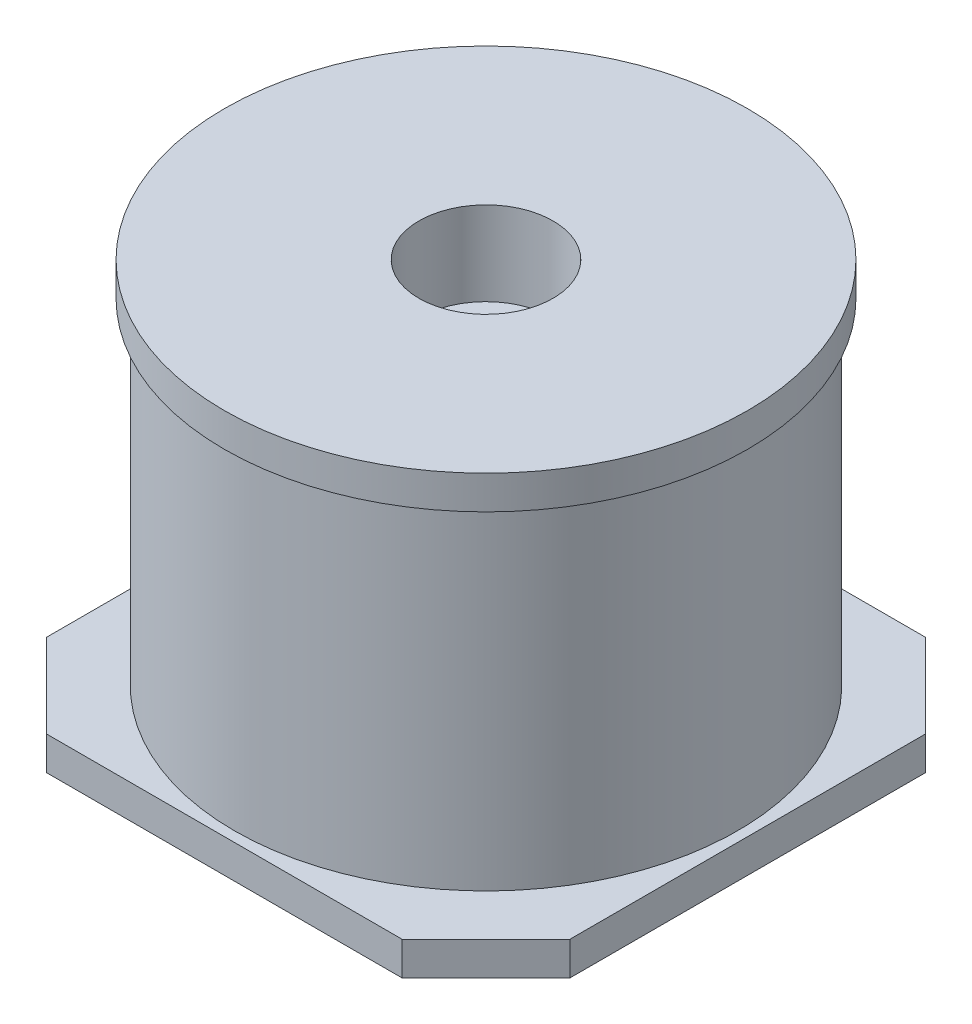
ISO-10303-21;
HEADER;
FILE_DESCRIPTION(('STEP AP214'),'2;1');
FILE_NAME('part.step','',(''),(''),'','','');
FILE_SCHEMA(('AUTOMOTIVE_DESIGN { 1 0 10303 214 1 1 1 1 }'));
ENDSEC;
DATA;
#1=APPLICATION_CONTEXT('core data for automotive mechanical design processes');
#2=APPLICATION_PROTOCOL_DEFINITION('international standard','automotive_design',2000,#1);
#3=PRODUCT_CONTEXT('',#1,'mechanical');
#4=PRODUCT('Part','Part','',(#3));
#5=PRODUCT_RELATED_PRODUCT_CATEGORY('part','',(#4));
#6=PRODUCT_DEFINITION_FORMATION('','',#4);
#7=PRODUCT_DEFINITION_CONTEXT('part definition',#1,'design');
#8=PRODUCT_DEFINITION('design','',#6,#7);
#9=PRODUCT_DEFINITION_SHAPE('','',#8);
#10=(LENGTH_UNIT() NAMED_UNIT(*) SI_UNIT(.MILLI.,.METRE.));
#11=(NAMED_UNIT(*) PLANE_ANGLE_UNIT() SI_UNIT($,.RADIAN.));
#12=(NAMED_UNIT(*) SI_UNIT($,.STERADIAN.) SOLID_ANGLE_UNIT());
#13=UNCERTAINTY_MEASURE_WITH_UNIT(LENGTH_MEASURE(1.E-05),#10,'distance_accuracy_value','');
#14=(GEOMETRIC_REPRESENTATION_CONTEXT(3) GLOBAL_UNCERTAINTY_ASSIGNED_CONTEXT((#13)) GLOBAL_UNIT_ASSIGNED_CONTEXT((#10,
#11,#12)) REPRESENTATION_CONTEXT('',''));
#15=CARTESIAN_POINT('',(0.,0.,0.));
#16=DIRECTION('',(0.,0.,1.));
#17=DIRECTION('',(1.,0.,0.));
#18=AXIS2_PLACEMENT_3D('',#15,#16,#17);
#19=CARTESIAN_POINT('',(0.,5.08,0.));
#20=DIRECTION('',(0.,-1.,0.));
#21=DIRECTION('',(0.,0.,-1.));
#22=AXIS2_PLACEMENT_3D('',#19,#20,#21);
#23=CYLINDRICAL_SURFACE('',#22,3.81);
#24=CARTESIAN_POINT('',(0.,5.08,0.));
#25=DIRECTION('',(0.,1.,0.));
#26=DIRECTION('',(0.,0.,1.));
#27=AXIS2_PLACEMENT_3D('',#24,#25,#26);
#28=CIRCLE('',#27,3.81);
#29=CARTESIAN_POINT('',(0.,5.08,3.81));
#30=VERTEX_POINT('',#29);
#31=EDGE_CURVE('E11',#30,#30,#28,.T.);
#32=ORIENTED_EDGE('',*,*,#31,.F.);
#33=EDGE_LOOP('',(#32));
#34=FACE_BOUND('',#33,.T.);
#35=CARTESIAN_POINT('',(0.,0.,0.));
#36=DIRECTION('',(0.,-1.,0.));
#37=DIRECTION('',(0.,0.,-1.));
#38=AXIS2_PLACEMENT_3D('',#35,#36,#37);
#39=CIRCLE('',#38,3.81);
#40=CARTESIAN_POINT('',(0.,0.,-3.81));
#41=VERTEX_POINT('',#40);
#42=EDGE_CURVE('E161',#41,#41,#39,.T.);
#43=ORIENTED_EDGE('',*,*,#42,.F.);
#44=EDGE_LOOP('',(#43));
#45=FACE_BOUND('',#44,.T.);
#46=ADVANCED_FACE('F34',(#34,#45),#23,.T.);
#47=CARTESIAN_POINT('',(0.,5.588,0.));
#48=DIRECTION('',(0.,-1.,0.));
#49=DIRECTION('',(0.,0.,-1.));
#50=AXIS2_PLACEMENT_3D('',#47,#48,#49);
#51=CYLINDRICAL_SURFACE('',#50,3.9624);
#52=CARTESIAN_POINT('',(0.,5.588,0.));
#53=DIRECTION('',(0.,1.,0.));
#54=DIRECTION('',(0.,0.,1.));
#55=AXIS2_PLACEMENT_3D('',#52,#53,#54);
#56=CIRCLE('',#55,3.9624);
#57=CARTESIAN_POINT('',(0.,5.588,3.9624));
#58=VERTEX_POINT('',#57);
#59=EDGE_CURVE('E42',#58,#58,#56,.T.);
#60=ORIENTED_EDGE('',*,*,#59,.F.);
#61=EDGE_LOOP('',(#60));
#62=FACE_BOUND('',#61,.T.);
#63=CARTESIAN_POINT('',(0.,5.08,0.));
#64=DIRECTION('',(0.,1.,0.));
#65=DIRECTION('',(0.,0.,1.));
#66=AXIS2_PLACEMENT_3D('',#63,#64,#65);
#67=CIRCLE('',#66,3.9624);
#68=CARTESIAN_POINT('',(0.,5.08,3.9624));
#69=VERTEX_POINT('',#68);
#70=EDGE_CURVE('E168',#69,#69,#67,.T.);
#71=ORIENTED_EDGE('',*,*,#70,.T.);
#72=EDGE_LOOP('',(#71));
#73=FACE_BOUND('',#72,.T.);
#74=ADVANCED_FACE('F175',(#62,#73),#51,.T.);
#75=CARTESIAN_POINT('',(0.,5.588,0.));
#76=DIRECTION('',(0.,1.,0.));
#77=DIRECTION('',(0.,0.,1.));
#78=AXIS2_PLACEMENT_3D('',#75,#76,#77);
#79=PLANE('',#78);
#80=CARTESIAN_POINT('',(0.,5.588,0.));
#81=DIRECTION('',(0.,1.,0.));
#82=DIRECTION('',(0.,0.,1.));
#83=AXIS2_PLACEMENT_3D('',#80,#81,#82);
#84=CIRCLE('',#83,1.016);
#85=CARTESIAN_POINT('',(0.,5.588,1.016));
#86=VERTEX_POINT('',#85);
#87=EDGE_CURVE('E164',#86,#86,#84,.T.);
#88=ORIENTED_EDGE('',*,*,#87,.F.);
#89=EDGE_LOOP('',(#88));
#90=FACE_BOUND('',#89,.T.);
#91=ORIENTED_EDGE('',*,*,#59,.T.);
#92=EDGE_LOOP('',(#91));
#93=FACE_BOUND('',#92,.T.);
#94=ADVANCED_FACE('F180',(#90,#93),#79,.T.);
#95=CARTESIAN_POINT('',(0.,5.08,0.));
#96=DIRECTION('',(0.,1.,0.));
#97=DIRECTION('',(0.,0.,1.));
#98=AXIS2_PLACEMENT_3D('',#95,#96,#97);
#99=PLANE('',#98);
#100=ORIENTED_EDGE('',*,*,#31,.T.);
#101=EDGE_LOOP('',(#100));
#102=FACE_BOUND('',#101,.T.);
#103=ORIENTED_EDGE('',*,*,#70,.F.);
#104=EDGE_LOOP('',(#103));
#105=FACE_BOUND('',#104,.T.);
#106=ADVANCED_FACE('F177',(#102,#105),#99,.F.);
#107=CARTESIAN_POINT('',(0.,4.318,0.));
#108=DIRECTION('',(0.,1.,0.));
#109=DIRECTION('',(0.,0.,1.));
#110=AXIS2_PLACEMENT_3D('',#107,#108,#109);
#111=CYLINDRICAL_SURFACE('',#110,1.016);
#112=CARTESIAN_POINT('',(0.,4.318,0.));
#113=DIRECTION('',(0.,1.,0.));
#114=DIRECTION('',(0.,0.,1.));
#115=AXIS2_PLACEMENT_3D('',#112,#113,#114);
#116=CIRCLE('',#115,1.016);
#117=CARTESIAN_POINT('',(0.,4.318,1.016));
#118=VERTEX_POINT('',#117);
#119=EDGE_CURVE('E165',#118,#118,#116,.T.);
#120=ORIENTED_EDGE('',*,*,#119,.F.);
#121=EDGE_LOOP('',(#120));
#122=FACE_BOUND('',#121,.T.);
#123=ORIENTED_EDGE('',*,*,#87,.T.);
#124=EDGE_LOOP('',(#123));
#125=FACE_BOUND('',#124,.T.);
#126=ADVANCED_FACE('F179',(#122,#125),#111,.F.);
#127=CARTESIAN_POINT('',(0.,4.318,0.));
#128=DIRECTION('',(0.,1.,0.));
#129=DIRECTION('',(0.,0.,1.));
#130=AXIS2_PLACEMENT_3D('',#127,#128,#129);
#131=PLANE('',#130);
#132=ORIENTED_EDGE('',*,*,#119,.T.);
#133=EDGE_LOOP('',(#132));
#134=FACE_BOUND('',#133,.T.);
#135=ADVANCED_FACE('F187',(#134),#131,.T.);
#136=CARTESIAN_POINT('',(-2.6924,-0.508,3.9624));
#137=DIRECTION('',(0.,0.,-1.));
#138=DIRECTION('',(-1.,0.,0.));
#139=AXIS2_PLACEMENT_3D('',#136,#137,#138);
#140=PLANE('',#139);
#141=DIRECTION('',(-1.,0.,0.));
#142=VECTOR('',#141,1.);
#143=CARTESIAN_POINT('',(-2.6924,0.,3.9624));
#144=LINE('',#143,#142);
#145=CARTESIAN_POINT('',(2.6924,0.,3.9624));
#146=VERTEX_POINT('',#145);
#147=CARTESIAN_POINT('',(-2.6924,0.,3.9624));
#148=VERTEX_POINT('',#147);
#149=EDGE_CURVE('E131',#146,#148,#144,.T.);
#150=ORIENTED_EDGE('',*,*,#149,.T.);
#151=DIRECTION('',(0.,1.,0.));
#152=VECTOR('',#151,1.);
#153=CARTESIAN_POINT('',(-2.6924,-0.508,3.9624));
#154=LINE('',#153,#152);
#155=CARTESIAN_POINT('',(-2.6924,-0.508,3.9624));
#156=VERTEX_POINT('',#155);
#157=EDGE_CURVE('E159',#156,#148,#154,.T.);
#158=ORIENTED_EDGE('',*,*,#157,.F.);
#159=DIRECTION('',(-1.,0.,0.));
#160=VECTOR('',#159,1.);
#161=CARTESIAN_POINT('',(-2.6924,-0.508,3.9624));
#162=LINE('',#161,#160);
#163=CARTESIAN_POINT('',(2.6924,-0.508,3.9624));
#164=VERTEX_POINT('',#163);
#165=EDGE_CURVE('E146',#164,#156,#162,.T.);
#166=ORIENTED_EDGE('',*,*,#165,.F.);
#167=DIRECTION('',(0.,1.,0.));
#168=VECTOR('',#167,1.);
#169=CARTESIAN_POINT('',(2.6924,-0.508,3.9624));
#170=LINE('',#169,#168);
#171=EDGE_CURVE('E127',#164,#146,#170,.T.);
#172=ORIENTED_EDGE('',*,*,#171,.T.);
#173=EDGE_LOOP('',(#150,#158,#166,#172));
#174=FACE_BOUND('',#173,.T.);
#175=ADVANCED_FACE('F211',(#174),#140,.F.);
#176=CARTESIAN_POINT('',(-3.9624,-0.508,2.6924));
#177=DIRECTION('',(0.707106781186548,0.,-0.707106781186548));
#178=DIRECTION('',(-0.707106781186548,0.,-0.707106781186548));
#179=AXIS2_PLACEMENT_3D('',#176,#177,#178);
#180=PLANE('',#179);
#181=DIRECTION('',(-0.707106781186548,0.,-0.707106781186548));
#182=VECTOR('',#181,1.);
#183=CARTESIAN_POINT('',(-3.9624,0.,2.6924));
#184=LINE('',#183,#182);
#185=CARTESIAN_POINT('',(-3.9624,0.,2.6924));
#186=VERTEX_POINT('',#185);
#187=EDGE_CURVE('E134',#148,#186,#184,.T.);
#188=ORIENTED_EDGE('',*,*,#187,.T.);
#189=DIRECTION('',(0.,1.,0.));
#190=VECTOR('',#189,1.);
#191=CARTESIAN_POINT('',(-3.9624,-0.508,2.6924));
#192=LINE('',#191,#190);
#193=CARTESIAN_POINT('',(-3.9624,-0.508,2.6924));
#194=VERTEX_POINT('',#193);
#195=EDGE_CURVE('E156',#194,#186,#192,.T.);
#196=ORIENTED_EDGE('',*,*,#195,.F.);
#197=DIRECTION('',(-0.707106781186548,0.,-0.707106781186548));
#198=VECTOR('',#197,1.);
#199=CARTESIAN_POINT('',(-3.9624,-0.508,2.6924));
#200=LINE('',#199,#198);
#201=EDGE_CURVE('E94',#156,#194,#200,.T.);
#202=ORIENTED_EDGE('',*,*,#201,.F.);
#203=ORIENTED_EDGE('',*,*,#157,.T.);
#204=EDGE_LOOP('',(#188,#196,#202,#203));
#205=FACE_BOUND('',#204,.T.);
#206=ADVANCED_FACE('F237',(#205),#180,.F.);
#207=CARTESIAN_POINT('',(-3.9624,-0.508,-2.6924));
#208=DIRECTION('',(1.,0.,0.));
#209=DIRECTION('',(0.,0.,-1.));
#210=AXIS2_PLACEMENT_3D('',#207,#208,#209);
#211=PLANE('',#210);
#212=DIRECTION('',(0.,0.,-1.));
#213=VECTOR('',#212,1.);
#214=CARTESIAN_POINT('',(-3.9624,0.,-2.6924));
#215=LINE('',#214,#213);
#216=CARTESIAN_POINT('',(-3.9624,0.,-2.6924));
#217=VERTEX_POINT('',#216);
#218=EDGE_CURVE('E137',#186,#217,#215,.T.);
#219=ORIENTED_EDGE('',*,*,#218,.T.);
#220=DIRECTION('',(0.,1.,0.));
#221=VECTOR('',#220,1.);
#222=CARTESIAN_POINT('',(-3.9624,-0.508,-2.6924));
#223=LINE('',#222,#221);
#224=CARTESIAN_POINT('',(-3.9624,-0.508,-2.6924));
#225=VERTEX_POINT('',#224);
#226=EDGE_CURVE('E153',#225,#217,#223,.T.);
#227=ORIENTED_EDGE('',*,*,#226,.F.);
#228=DIRECTION('',(0.,0.,-1.));
#229=VECTOR('',#228,1.);
#230=CARTESIAN_POINT('',(-3.9624,-0.508,-2.6924));
#231=LINE('',#230,#229);
#232=EDGE_CURVE('E330',#194,#225,#231,.T.);
#233=ORIENTED_EDGE('',*,*,#232,.F.);
#234=ORIENTED_EDGE('',*,*,#195,.T.);
#235=EDGE_LOOP('',(#219,#227,#233,#234));
#236=FACE_BOUND('',#235,.T.);
#237=ADVANCED_FACE('F233',(#236),#211,.F.);
#238=CARTESIAN_POINT('',(-3.9624,-0.508,-2.6924));
#239=DIRECTION('',(0.707106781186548,0.,0.707106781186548));
#240=DIRECTION('',(0.707106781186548,0.,-0.707106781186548));
#241=AXIS2_PLACEMENT_3D('',#238,#239,#240);
#242=PLANE('',#241);
#243=DIRECTION('',(0.707106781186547,0.,-0.707106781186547));
#244=VECTOR('',#243,1.);
#245=CARTESIAN_POINT('',(-3.9624,0.,-2.6924));
#246=LINE('',#245,#244);
#247=CARTESIAN_POINT('',(-2.6924,0.,-3.9624));
#248=VERTEX_POINT('',#247);
#249=EDGE_CURVE('E139',#217,#248,#246,.T.);
#250=ORIENTED_EDGE('',*,*,#249,.T.);
#251=DIRECTION('',(0.,1.,0.));
#252=VECTOR('',#251,1.);
#253=CARTESIAN_POINT('',(-2.6924,-0.508,-3.9624));
#254=LINE('',#253,#252);
#255=CARTESIAN_POINT('',(-2.6924,-0.508,-3.9624));
#256=VERTEX_POINT('',#255);
#257=EDGE_CURVE('E150',#256,#248,#254,.T.);
#258=ORIENTED_EDGE('',*,*,#257,.F.);
#259=DIRECTION('',(0.707106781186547,0.,-0.707106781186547));
#260=VECTOR('',#259,1.);
#261=CARTESIAN_POINT('',(-3.9624,-0.508,-2.6924));
#262=LINE('',#261,#260);
#263=EDGE_CURVE('E332',#225,#256,#262,.T.);
#264=ORIENTED_EDGE('',*,*,#263,.F.);
#265=ORIENTED_EDGE('',*,*,#226,.T.);
#266=EDGE_LOOP('',(#250,#258,#264,#265));
#267=FACE_BOUND('',#266,.T.);
#268=ADVANCED_FACE('F229',(#267),#242,.F.);
#269=CARTESIAN_POINT('',(-2.6924,-0.508,-3.9624));
#270=DIRECTION('',(0.,0.,1.));
#271=DIRECTION('',(1.,0.,0.));
#272=AXIS2_PLACEMENT_3D('',#269,#270,#271);
#273=PLANE('',#272);
#274=DIRECTION('',(1.,0.,0.));
#275=VECTOR('',#274,1.);
#276=CARTESIAN_POINT('',(-2.6924,0.,-3.9624));
#277=LINE('',#276,#275);
#278=CARTESIAN_POINT('',(2.6924,0.,-3.9624));
#279=VERTEX_POINT('',#278);
#280=EDGE_CURVE('E141',#248,#279,#277,.T.);
#281=ORIENTED_EDGE('',*,*,#280,.T.);
#282=DIRECTION('',(0.,1.,0.));
#283=VECTOR('',#282,1.);
#284=CARTESIAN_POINT('',(2.6924,-0.508,-3.9624));
#285=LINE('',#284,#283);
#286=CARTESIAN_POINT('',(2.6924,-0.508,-3.9624));
#287=VERTEX_POINT('',#286);
#288=EDGE_CURVE('E122',#287,#279,#285,.T.);
#289=ORIENTED_EDGE('',*,*,#288,.F.);
#290=DIRECTION('',(1.,0.,0.));
#291=VECTOR('',#290,1.);
#292=CARTESIAN_POINT('',(-2.6924,-0.508,-3.9624));
#293=LINE('',#292,#291);
#294=EDGE_CURVE('E113',#256,#287,#293,.T.);
#295=ORIENTED_EDGE('',*,*,#294,.F.);
#296=ORIENTED_EDGE('',*,*,#257,.T.);
#297=EDGE_LOOP('',(#281,#289,#295,#296));
#298=FACE_BOUND('',#297,.T.);
#299=ADVANCED_FACE('F226',(#298),#273,.F.);
#300=CARTESIAN_POINT('',(2.6924,-0.508,-3.9624));
#301=DIRECTION('',(-0.707106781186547,0.,0.707106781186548));
#302=DIRECTION('',(0.707106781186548,0.,0.707106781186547));
#303=AXIS2_PLACEMENT_3D('',#300,#301,#302);
#304=PLANE('',#303);
#305=DIRECTION('',(0.707106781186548,0.,0.707106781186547));
#306=VECTOR('',#305,1.);
#307=CARTESIAN_POINT('',(2.6924,0.,-3.9624));
#308=LINE('',#307,#306);
#309=CARTESIAN_POINT('',(3.9624,0.,-2.6924));
#310=VERTEX_POINT('',#309);
#311=EDGE_CURVE('E121',#279,#310,#308,.T.);
#312=ORIENTED_EDGE('',*,*,#311,.T.);
#313=DIRECTION('',(0.,1.,0.));
#314=VECTOR('',#313,1.);
#315=CARTESIAN_POINT('',(3.9624,-0.508,-2.6924));
#316=LINE('',#315,#314);
#317=CARTESIAN_POINT('',(3.9624,-0.508,-2.6924));
#318=VERTEX_POINT('',#317);
#319=EDGE_CURVE('E118',#318,#310,#316,.T.);
#320=ORIENTED_EDGE('',*,*,#319,.F.);
#321=DIRECTION('',(0.707106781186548,0.,0.707106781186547));
#322=VECTOR('',#321,1.);
#323=CARTESIAN_POINT('',(2.6924,-0.508,-3.9624));
#324=LINE('',#323,#322);
#325=EDGE_CURVE('E107',#287,#318,#324,.T.);
#326=ORIENTED_EDGE('',*,*,#325,.F.);
#327=ORIENTED_EDGE('',*,*,#288,.T.);
#328=EDGE_LOOP('',(#312,#320,#326,#327));
#329=FACE_BOUND('',#328,.T.);
#330=ADVANCED_FACE('F119',(#329),#304,.F.);
#331=CARTESIAN_POINT('',(3.9624,-0.508,-2.6924));
#332=DIRECTION('',(-1.,0.,0.));
#333=DIRECTION('',(0.,0.,1.));
#334=AXIS2_PLACEMENT_3D('',#331,#332,#333);
#335=PLANE('',#334);
#336=DIRECTION('',(0.,0.,1.));
#337=VECTOR('',#336,1.);
#338=CARTESIAN_POINT('',(3.9624,0.,-2.6924));
#339=LINE('',#338,#337);
#340=CARTESIAN_POINT('',(3.9624,0.,2.6924));
#341=VERTEX_POINT('',#340);
#342=EDGE_CURVE('E79',#310,#341,#339,.T.);
#343=ORIENTED_EDGE('',*,*,#342,.T.);
#344=DIRECTION('',(0.,1.,0.));
#345=VECTOR('',#344,1.);
#346=CARTESIAN_POINT('',(3.9624,-0.508,2.6924));
#347=LINE('',#346,#345);
#348=CARTESIAN_POINT('',(3.9624,-0.508,2.6924));
#349=VERTEX_POINT('',#348);
#350=EDGE_CURVE('E123',#349,#341,#347,.T.);
#351=ORIENTED_EDGE('',*,*,#350,.F.);
#352=DIRECTION('',(0.,0.,1.));
#353=VECTOR('',#352,1.);
#354=CARTESIAN_POINT('',(3.9624,-0.508,-2.6924));
#355=LINE('',#354,#353);
#356=EDGE_CURVE('E111',#318,#349,#355,.T.);
#357=ORIENTED_EDGE('',*,*,#356,.F.);
#358=ORIENTED_EDGE('',*,*,#319,.T.);
#359=EDGE_LOOP('',(#343,#351,#357,#358));
#360=FACE_BOUND('',#359,.T.);
#361=ADVANCED_FACE('F125',(#360),#335,.F.);
#362=CARTESIAN_POINT('',(2.6924,-0.508,3.9624));
#363=DIRECTION('',(-0.707106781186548,0.,-0.707106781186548));
#364=DIRECTION('',(-0.707106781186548,0.,0.707106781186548));
#365=AXIS2_PLACEMENT_3D('',#362,#363,#364);
#366=PLANE('',#365);
#367=DIRECTION('',(-0.707106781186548,0.,0.707106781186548));
#368=VECTOR('',#367,1.);
#369=CARTESIAN_POINT('',(2.6924,0.,3.9624));
#370=LINE('',#369,#368);
#371=EDGE_CURVE('E85',#341,#146,#370,.T.);
#372=ORIENTED_EDGE('',*,*,#371,.T.);
#373=ORIENTED_EDGE('',*,*,#171,.F.);
#374=DIRECTION('',(-0.707106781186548,0.,0.707106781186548));
#375=VECTOR('',#374,1.);
#376=CARTESIAN_POINT('',(2.6924,-0.508,3.9624));
#377=LINE('',#376,#375);
#378=EDGE_CURVE('E50',#349,#164,#377,.T.);
#379=ORIENTED_EDGE('',*,*,#378,.F.);
#380=ORIENTED_EDGE('',*,*,#350,.T.);
#381=EDGE_LOOP('',(#372,#373,#379,#380));
#382=FACE_BOUND('',#381,.T.);
#383=ADVANCED_FACE('F213',(#382),#366,.F.);
#384=CARTESIAN_POINT('',(0.,-0.508,0.));
#385=DIRECTION('',(0.,-1.,0.));
#386=DIRECTION('',(0.,0.,-1.));
#387=AXIS2_PLACEMENT_3D('',#384,#385,#386);
#388=PLANE('',#387);
#389=CARTESIAN_POINT('',(0.,-0.508,0.));
#390=DIRECTION('',(0.,-1.,0.));
#391=DIRECTION('',(0.,0.,-1.));
#392=AXIS2_PLACEMENT_3D('',#389,#390,#391);
#393=CIRCLE('',#392,1.016);
#394=CARTESIAN_POINT('',(0.,-0.508,-1.016));
#395=VERTEX_POINT('',#394);
#396=EDGE_CURVE('E323',#395,#395,#393,.T.);
#397=ORIENTED_EDGE('',*,*,#396,.F.);
#398=EDGE_LOOP('',(#397));
#399=FACE_BOUND('',#398,.T.);
#400=ORIENTED_EDGE('',*,*,#165,.T.);
#401=ORIENTED_EDGE('',*,*,#201,.T.);
#402=ORIENTED_EDGE('',*,*,#232,.T.);
#403=ORIENTED_EDGE('',*,*,#263,.T.);
#404=ORIENTED_EDGE('',*,*,#294,.T.);
#405=ORIENTED_EDGE('',*,*,#325,.T.);
#406=ORIENTED_EDGE('',*,*,#356,.T.);
#407=ORIENTED_EDGE('',*,*,#378,.T.);
#408=EDGE_LOOP('',(#400,#401,#402,#403,#404,#405,#406,#407));
#409=FACE_BOUND('',#408,.T.);
#410=ADVANCED_FACE('F109',(#399,#409),#388,.T.);
#411=CARTESIAN_POINT('',(0.,0.,0.));
#412=DIRECTION('',(0.,-1.,0.));
#413=DIRECTION('',(0.,0.,-1.));
#414=AXIS2_PLACEMENT_3D('',#411,#412,#413);
#415=PLANE('',#414);
#416=ORIENTED_EDGE('',*,*,#42,.T.);
#417=EDGE_LOOP('',(#416));
#418=FACE_BOUND('',#417,.T.);
#419=ORIENTED_EDGE('',*,*,#149,.F.);
#420=ORIENTED_EDGE('',*,*,#371,.F.);
#421=ORIENTED_EDGE('',*,*,#342,.F.);
#422=ORIENTED_EDGE('',*,*,#311,.F.);
#423=ORIENTED_EDGE('',*,*,#280,.F.);
#424=ORIENTED_EDGE('',*,*,#249,.F.);
#425=ORIENTED_EDGE('',*,*,#218,.F.);
#426=ORIENTED_EDGE('',*,*,#187,.F.);
#427=EDGE_LOOP('',(#419,#420,#421,#422,#423,#424,#425,#426));
#428=FACE_BOUND('',#427,.T.);
#429=ADVANCED_FACE('F202',(#418,#428),#415,.F.);
#430=CARTESIAN_POINT('',(0.,0.762,0.));
#431=DIRECTION('',(0.,-1.,0.));
#432=DIRECTION('',(0.,0.,-1.));
#433=AXIS2_PLACEMENT_3D('',#430,#431,#432);
#434=CYLINDRICAL_SURFACE('',#433,1.016);
#435=CARTESIAN_POINT('',(0.,0.762,0.));
#436=DIRECTION('',(0.,-1.,0.));
#437=DIRECTION('',(0.,0.,-1.));
#438=AXIS2_PLACEMENT_3D('',#435,#436,#437);
#439=CIRCLE('',#438,1.016);
#440=CARTESIAN_POINT('',(0.,0.762,-1.016));
#441=VERTEX_POINT('',#440);
#442=EDGE_CURVE('E135',#441,#441,#439,.T.);
#443=ORIENTED_EDGE('',*,*,#442,.F.);
#444=EDGE_LOOP('',(#443));
#445=FACE_BOUND('',#444,.T.);
#446=ORIENTED_EDGE('',*,*,#396,.T.);
#447=EDGE_LOOP('',(#446));
#448=FACE_BOUND('',#447,.T.);
#449=ADVANCED_FACE('F205',(#445,#448),#434,.F.);
#450=CARTESIAN_POINT('',(0.,0.762,0.));
#451=DIRECTION('',(0.,-1.,0.));
#452=DIRECTION('',(0.,0.,-1.));
#453=AXIS2_PLACEMENT_3D('',#450,#451,#452);
#454=PLANE('',#453);
#455=ORIENTED_EDGE('',*,*,#442,.T.);
#456=EDGE_LOOP('',(#455));
#457=FACE_BOUND('',#456,.T.);
#458=ADVANCED_FACE('F307',(#457),#454,.T.);
#459=CLOSED_SHELL('',(#46,#74,#94,#106,#126,#135,#175,#206,#237,#268,#299,#330,#361,#383,#410,
#429,#449,#458));
#460=MANIFOLD_SOLID_BREP('B2',#459);
#461=ADVANCED_BREP_SHAPE_REPRESENTATION('',(#18,#460),#14);
#462=SHAPE_DEFINITION_REPRESENTATION(#9,#461);
ENDSEC;
END-ISO-10303-21;
